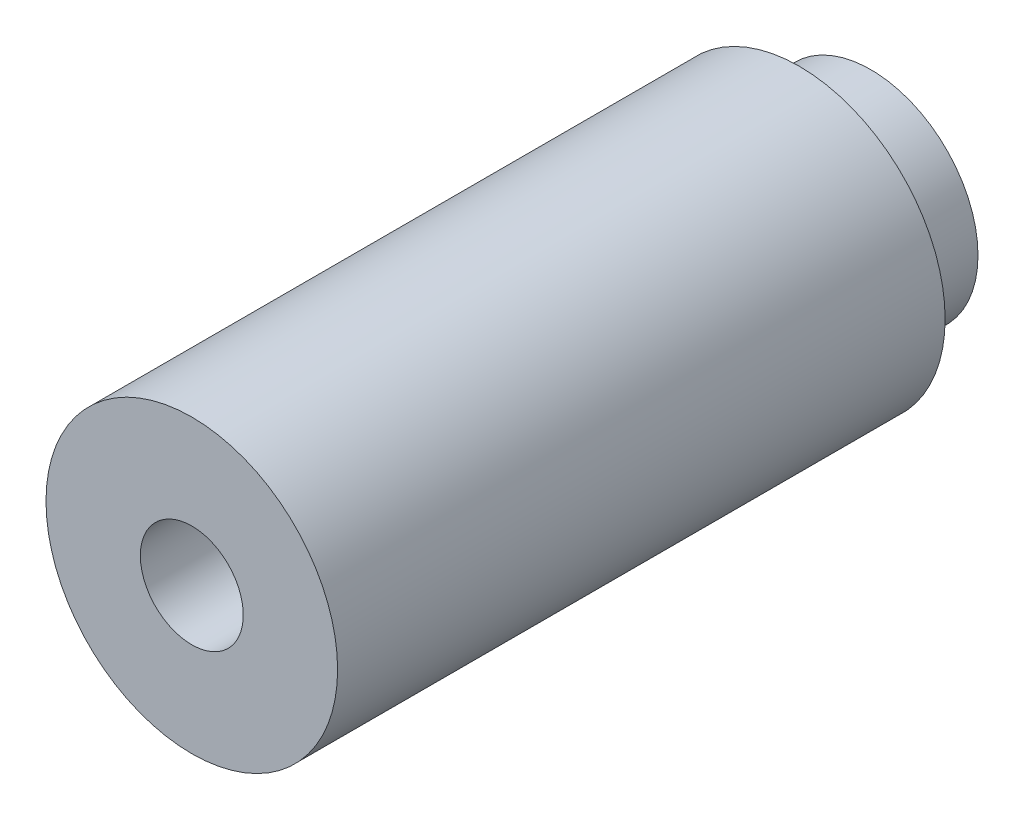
ISO-10303-21;
HEADER;
FILE_DESCRIPTION(('STEP AP214'),'2;1');
FILE_NAME('part.step','',(''),(''),'','','');
FILE_SCHEMA(('AUTOMOTIVE_DESIGN { 1 0 10303 214 1 1 1 1 }'));
ENDSEC;
DATA;
#1=APPLICATION_CONTEXT('core data for automotive mechanical design processes');
#2=APPLICATION_PROTOCOL_DEFINITION('international standard','automotive_design',2000,#1);
#3=PRODUCT_CONTEXT('',#1,'mechanical');
#4=PRODUCT('Part','Part','',(#3));
#5=PRODUCT_RELATED_PRODUCT_CATEGORY('part','',(#4));
#6=PRODUCT_DEFINITION_FORMATION('','',#4);
#7=PRODUCT_DEFINITION_CONTEXT('part definition',#1,'design');
#8=PRODUCT_DEFINITION('design','',#6,#7);
#9=PRODUCT_DEFINITION_SHAPE('','',#8);
#10=(LENGTH_UNIT() NAMED_UNIT(*) SI_UNIT(.MILLI.,.METRE.));
#11=(NAMED_UNIT(*) PLANE_ANGLE_UNIT() SI_UNIT($,.RADIAN.));
#12=(NAMED_UNIT(*) SI_UNIT($,.STERADIAN.) SOLID_ANGLE_UNIT());
#13=UNCERTAINTY_MEASURE_WITH_UNIT(LENGTH_MEASURE(1.E-05),#10,'distance_accuracy_value','');
#14=(GEOMETRIC_REPRESENTATION_CONTEXT(3) GLOBAL_UNCERTAINTY_ASSIGNED_CONTEXT((#13)) GLOBAL_UNIT_ASSIGNED_CONTEXT((#10,
#11,#12)) REPRESENTATION_CONTEXT('',''));
#15=CARTESIAN_POINT('',(0.,0.,0.));
#16=DIRECTION('',(0.,0.,1.));
#17=DIRECTION('',(1.,0.,0.));
#18=AXIS2_PLACEMENT_3D('',#15,#16,#17);
#19=CARTESIAN_POINT('',(0.,0.,53.975));
#20=DIRECTION('',(0.,0.,-1.));
#21=DIRECTION('',(-1.,0.,0.));
#22=AXIS2_PLACEMENT_3D('',#19,#20,#21);
#23=CYLINDRICAL_SURFACE('',#22,12.954);
#24=CARTESIAN_POINT('',(0.,0.,53.975));
#25=DIRECTION('',(0.,0.,1.));
#26=DIRECTION('',(1.,0.,0.));
#27=AXIS2_PLACEMENT_3D('',#24,#25,#26);
#28=CIRCLE('',#27,12.954);
#29=CARTESIAN_POINT('',(12.954,0.,53.975));
#30=VERTEX_POINT('',#29);
#31=EDGE_CURVE('E47',#30,#30,#28,.T.);
#32=ORIENTED_EDGE('',*,*,#31,.F.);
#33=EDGE_LOOP('',(#32));
#34=FACE_BOUND('',#33,.T.);
#35=CARTESIAN_POINT('',(0.,0.,0.));
#36=DIRECTION('',(0.,0.,1.));
#37=DIRECTION('',(1.,0.,0.));
#38=AXIS2_PLACEMENT_3D('',#35,#36,#37);
#39=CIRCLE('',#38,12.954);
#40=CARTESIAN_POINT('',(12.954,0.,0.));
#41=VERTEX_POINT('',#40);
#42=EDGE_CURVE('E42',#41,#41,#39,.T.);
#43=ORIENTED_EDGE('',*,*,#42,.T.);
#44=EDGE_LOOP('',(#43));
#45=FACE_BOUND('',#44,.T.);
#46=ADVANCED_FACE('F39',(#34,#45),#23,.T.);
#47=CARTESIAN_POINT('',(0.,0.,53.975));
#48=DIRECTION('',(0.,0.,1.));
#49=DIRECTION('',(1.,0.,0.));
#50=AXIS2_PLACEMENT_3D('',#47,#48,#49);
#51=PLANE('',#50);
#52=CARTESIAN_POINT('',(0.,0.,53.975));
#53=DIRECTION('',(0.,0.,-1.));
#54=DIRECTION('',(-1.,0.,0.));
#55=AXIS2_PLACEMENT_3D('',#52,#53,#54);
#56=CIRCLE('',#55,4.572);
#57=CARTESIAN_POINT('',(-4.572,0.,53.975));
#58=VERTEX_POINT('',#57);
#59=EDGE_CURVE('E58',#58,#58,#56,.T.);
#60=ORIENTED_EDGE('',*,*,#59,.T.);
#61=EDGE_LOOP('',(#60));
#62=FACE_BOUND('',#61,.T.);
#63=ORIENTED_EDGE('',*,*,#31,.T.);
#64=EDGE_LOOP('',(#63));
#65=FACE_BOUND('',#64,.T.);
#66=ADVANCED_FACE('F67',(#62,#65),#51,.T.);
#67=CARTESIAN_POINT('',(0.,0.,0.));
#68=DIRECTION('',(0.,0.,1.));
#69=DIRECTION('',(1.,0.,0.));
#70=AXIS2_PLACEMENT_3D('',#67,#68,#69);
#71=PLANE('',#70);
#72=CARTESIAN_POINT('',(0.,0.,0.));
#73=DIRECTION('',(0.,0.,-1.));
#74=DIRECTION('',(-1.,0.,0.));
#75=AXIS2_PLACEMENT_3D('',#72,#73,#74);
#76=CIRCLE('',#75,9.525);
#77=CARTESIAN_POINT('',(-9.525,0.,0.));
#78=VERTEX_POINT('',#77);
#79=EDGE_CURVE('E10',#78,#78,#76,.T.);
#80=ORIENTED_EDGE('',*,*,#79,.F.);
#81=EDGE_LOOP('',(#80));
#82=FACE_BOUND('',#81,.T.);
#83=ORIENTED_EDGE('',*,*,#42,.F.);
#84=EDGE_LOOP('',(#83));
#85=FACE_BOUND('',#84,.T.);
#86=ADVANCED_FACE('F84',(#82,#85),#71,.F.);
#87=CARTESIAN_POINT('',(0.,0.,-6.35));
#88=DIRECTION('',(0.,0.,1.));
#89=DIRECTION('',(1.,0.,0.));
#90=AXIS2_PLACEMENT_3D('',#87,#88,#89);
#91=CYLINDRICAL_SURFACE('',#90,9.525);
#92=CARTESIAN_POINT('',(0.,0.,-6.35));
#93=DIRECTION('',(0.,0.,-1.));
#94=DIRECTION('',(-1.,0.,0.));
#95=AXIS2_PLACEMENT_3D('',#92,#93,#94);
#96=CIRCLE('',#95,9.525);
#97=CARTESIAN_POINT('',(-9.525,0.,-6.35));
#98=VERTEX_POINT('',#97);
#99=EDGE_CURVE('E54',#98,#98,#96,.T.);
#100=ORIENTED_EDGE('',*,*,#99,.F.);
#101=EDGE_LOOP('',(#100));
#102=FACE_BOUND('',#101,.T.);
#103=ORIENTED_EDGE('',*,*,#79,.T.);
#104=EDGE_LOOP('',(#103));
#105=FACE_BOUND('',#104,.T.);
#106=ADVANCED_FACE('F79',(#102,#105),#91,.T.);
#107=CARTESIAN_POINT('',(0.,0.,-6.35));
#108=DIRECTION('',(0.,0.,-1.));
#109=DIRECTION('',(-1.,0.,0.));
#110=AXIS2_PLACEMENT_3D('',#107,#108,#109);
#111=PLANE('',#110);
#112=CARTESIAN_POINT('',(0.,0.,-6.35));
#113=DIRECTION('',(0.,0.,-1.));
#114=DIRECTION('',(-1.,0.,0.));
#115=AXIS2_PLACEMENT_3D('',#112,#113,#114);
#116=CIRCLE('',#115,4.572);
#117=CARTESIAN_POINT('',(-4.572,0.,-6.35));
#118=VERTEX_POINT('',#117);
#119=EDGE_CURVE('E59',#118,#118,#116,.T.);
#120=ORIENTED_EDGE('',*,*,#119,.F.);
#121=EDGE_LOOP('',(#120));
#122=FACE_BOUND('',#121,.T.);
#123=ORIENTED_EDGE('',*,*,#99,.T.);
#124=EDGE_LOOP('',(#123));
#125=FACE_BOUND('',#124,.T.);
#126=ADVANCED_FACE('F73',(#122,#125),#111,.T.);
#127=CARTESIAN_POINT('',(0.,0.,53.975));
#128=DIRECTION('',(0.,0.,-1.));
#129=DIRECTION('',(-1.,0.,0.));
#130=AXIS2_PLACEMENT_3D('',#127,#128,#129);
#131=CYLINDRICAL_SURFACE('',#130,4.572);
#132=CARTESIAN_POINT('',(-4.572,0.,53.975));
#133=CARTESIAN_POINT('',(-4.572,0.,53.3466145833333));
#134=CARTESIAN_POINT('',(-4.572,0.,52.7182291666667));
#135=CARTESIAN_POINT('',(-4.572,0.,51.4614583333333));
#136=CARTESIAN_POINT('',(-4.572,0.,50.8330729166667));
#137=CARTESIAN_POINT('',(-4.572,0.,49.5763020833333));
#138=CARTESIAN_POINT('',(-4.572,0.,48.9479166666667));
#139=CARTESIAN_POINT('',(-4.572,0.,47.6911458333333));
#140=CARTESIAN_POINT('',(-4.572,0.,47.0627604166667));
#141=CARTESIAN_POINT('',(-4.572,0.,45.8059895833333));
#142=CARTESIAN_POINT('',(-4.572,0.,45.1776041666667));
#143=CARTESIAN_POINT('',(-4.572,0.,43.9208333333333));
#144=CARTESIAN_POINT('',(-4.572,0.,43.2924479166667));
#145=CARTESIAN_POINT('',(-4.572,0.,42.0356770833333));
#146=CARTESIAN_POINT('',(-4.572,0.,41.4072916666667));
#147=CARTESIAN_POINT('',(-4.572,0.,40.1505208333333));
#148=CARTESIAN_POINT('',(-4.572,0.,39.5221354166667));
#149=CARTESIAN_POINT('',(-4.572,0.,38.2653645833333));
#150=CARTESIAN_POINT('',(-4.572,0.,37.6369791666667));
#151=CARTESIAN_POINT('',(-4.572,0.,36.3802083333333));
#152=CARTESIAN_POINT('',(-4.572,0.,35.7518229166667));
#153=CARTESIAN_POINT('',(-4.572,0.,34.4950520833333));
#154=CARTESIAN_POINT('',(-4.572,0.,33.8666666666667));
#155=CARTESIAN_POINT('',(-4.572,0.,32.6098958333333));
#156=CARTESIAN_POINT('',(-4.572,0.,31.9815104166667));
#157=CARTESIAN_POINT('',(-4.572,0.,30.7247395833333));
#158=CARTESIAN_POINT('',(-4.572,0.,30.0963541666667));
#159=CARTESIAN_POINT('',(-4.572,0.,28.8395833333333));
#160=CARTESIAN_POINT('',(-4.572,0.,28.2111979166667));
#161=CARTESIAN_POINT('',(-4.572,0.,26.9544270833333));
#162=CARTESIAN_POINT('',(-4.572,0.,26.3260416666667));
#163=CARTESIAN_POINT('',(-4.572,0.,25.0692708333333));
#164=CARTESIAN_POINT('',(-4.572,0.,24.4408854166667));
#165=CARTESIAN_POINT('',(-4.572,0.,23.1841145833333));
#166=CARTESIAN_POINT('',(-4.572,0.,22.5557291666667));
#167=CARTESIAN_POINT('',(-4.572,0.,21.2989583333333));
#168=CARTESIAN_POINT('',(-4.572,0.,20.6705729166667));
#169=CARTESIAN_POINT('',(-4.572,0.,19.4138020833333));
#170=CARTESIAN_POINT('',(-4.572,0.,18.7854166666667));
#171=CARTESIAN_POINT('',(-4.572,0.,17.5286458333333));
#172=CARTESIAN_POINT('',(-4.572,0.,16.9002604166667));
#173=CARTESIAN_POINT('',(-4.572,0.,15.6434895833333));
#174=CARTESIAN_POINT('',(-4.572,0.,15.0151041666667));
#175=CARTESIAN_POINT('',(-4.572,0.,13.7583333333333));
#176=CARTESIAN_POINT('',(-4.572,0.,13.1299479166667));
#177=CARTESIAN_POINT('',(-4.572,0.,11.8731770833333));
#178=CARTESIAN_POINT('',(-4.572,0.,11.2447916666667));
#179=CARTESIAN_POINT('',(-4.572,0.,9.98802083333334));
#180=CARTESIAN_POINT('',(-4.572,0.,9.35963541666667));
#181=CARTESIAN_POINT('',(-4.572,0.,8.10286458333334));
#182=CARTESIAN_POINT('',(-4.572,0.,7.47447916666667));
#183=CARTESIAN_POINT('',(-4.572,0.,6.21770833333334));
#184=CARTESIAN_POINT('',(-4.572,0.,5.58932291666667));
#185=CARTESIAN_POINT('',(-4.572,0.,4.33255208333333));
#186=CARTESIAN_POINT('',(-4.572,0.,3.70416666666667));
#187=CARTESIAN_POINT('',(-4.572,0.,2.44739583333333));
#188=CARTESIAN_POINT('',(-4.572,0.,1.81901041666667));
#189=CARTESIAN_POINT('',(-4.572,0.,0.562239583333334));
#190=CARTESIAN_POINT('',(-4.572,0.,-0.0661458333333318));
#191=CARTESIAN_POINT('',(-4.572,0.,-1.32291666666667));
#192=CARTESIAN_POINT('',(-4.572,0.,-1.95130208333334));
#193=CARTESIAN_POINT('',(-4.572,0.,-3.20807291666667));
#194=CARTESIAN_POINT('',(-4.572,0.,-3.83645833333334));
#195=CARTESIAN_POINT('',(-4.572,0.,-5.09322916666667));
#196=CARTESIAN_POINT('',(-4.572,0.,-5.72161458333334));
#197=CARTESIAN_POINT('',(-4.572,0.,-6.35));
#198=B_SPLINE_CURVE_WITH_KNOTS('',3,(#132,#133,#134,#135,#136,#137,#138,#139,#140,#141,#142,
#143,#144,#145,#146,#147,#148,#149,#150,#151,#152,#153,#154,#155,#156,#157,#158,#159,#160,#161,
#162,#163,#164,#165,#166,#167,#168,#169,#170,#171,#172,#173,#174,#175,#176,#177,#178,#179,#180,
#181,#182,#183,#184,#185,#186,#187,#188,#189,#190,#191,#192,#193,#194,#195,#196,#197),
.UNSPECIFIED.,.F.,.F.,(4,2,2,2,2,2,2,2,2,2,2,2,2,2,2,2,2,2,2,2,2,2,2,2,2,2,2,2,2,2,2,2,4),(0.,
1.88515625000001,3.7703125,5.65546875,7.540625,9.42578125,11.3109375,13.19609375,15.08125,
16.96640625,18.8515625,20.73671875,22.621875,24.50703125,26.3921875,28.27734375,30.1625,
32.04765625,33.9328125,35.81796875,37.703125,39.58828125,41.4734375,43.35859375,45.24375,
47.12890625,49.0140625,50.89921875,52.784375,54.66953125,56.5546875,58.43984375,60.325),.UNSPECIFIED.);
#199=EDGE_CURVE('BSEAM70',#58,#118,#198,.T.);
#200=ORIENTED_EDGE('',*,*,#59,.F.);
#201=ORIENTED_EDGE('',*,*,#119,.T.);
#202=ORIENTED_EDGE('',*,*,#199,.T.);
#203=ORIENTED_EDGE('',*,*,#199,.F.);
#204=EDGE_LOOP('',(#200,#202,#201,#203));
#205=FACE_BOUND('',#204,.T.);
#206=ADVANCED_FACE('F70',(#205),#131,.F.);
#207=CLOSED_SHELL('',(#46,#66,#86,#106,#126,#206));
#208=MANIFOLD_SOLID_BREP('B2',#207);
#209=ADVANCED_BREP_SHAPE_REPRESENTATION('',(#18,#208),#14);
#210=SHAPE_DEFINITION_REPRESENTATION(#9,#209);
ENDSEC;
END-ISO-10303-21;
